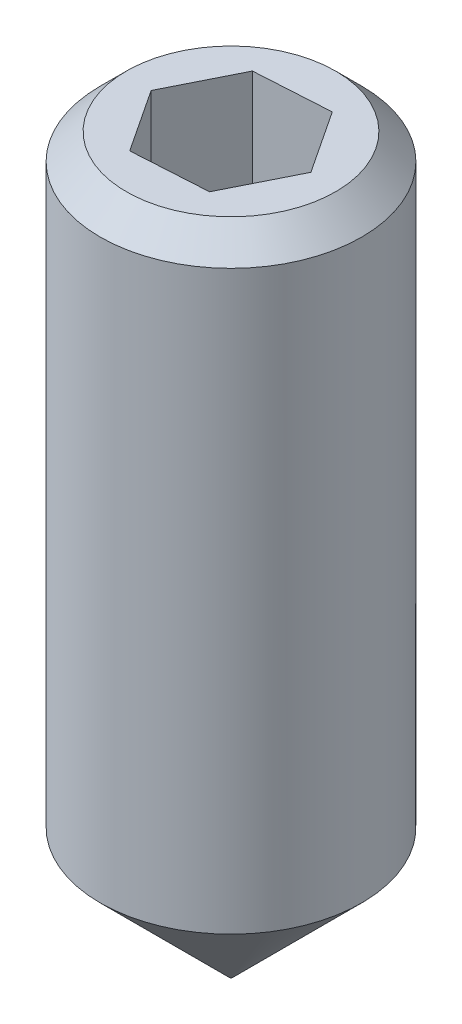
ISO-10303-21;
HEADER;
FILE_DESCRIPTION(('STEP AP214'),'2;1');
FILE_NAME('part.step','',(''),(''),'','','');
FILE_SCHEMA(('AUTOMOTIVE_DESIGN { 1 0 10303 214 1 1 1 1 }'));
ENDSEC;
DATA;
#1=APPLICATION_CONTEXT('core data for automotive mechanical design processes');
#2=APPLICATION_PROTOCOL_DEFINITION('international standard','automotive_design',2000,#1);
#3=PRODUCT_CONTEXT('',#1,'mechanical');
#4=PRODUCT('Part','Part','',(#3));
#5=PRODUCT_RELATED_PRODUCT_CATEGORY('part','',(#4));
#6=PRODUCT_DEFINITION_FORMATION('','',#4);
#7=PRODUCT_DEFINITION_CONTEXT('part definition',#1,'design');
#8=PRODUCT_DEFINITION('design','',#6,#7);
#9=PRODUCT_DEFINITION_SHAPE('','',#8);
#10=(LENGTH_UNIT() NAMED_UNIT(*) SI_UNIT(.MILLI.,.METRE.));
#11=(NAMED_UNIT(*) PLANE_ANGLE_UNIT() SI_UNIT($,.RADIAN.));
#12=(NAMED_UNIT(*) SI_UNIT($,.STERADIAN.) SOLID_ANGLE_UNIT());
#13=UNCERTAINTY_MEASURE_WITH_UNIT(LENGTH_MEASURE(1.E-05),#10,'distance_accuracy_value','');
#14=(GEOMETRIC_REPRESENTATION_CONTEXT(3) GLOBAL_UNCERTAINTY_ASSIGNED_CONTEXT((#13)) GLOBAL_UNIT_ASSIGNED_CONTEXT((#10,
#11,#12)) REPRESENTATION_CONTEXT('',''));
#15=CARTESIAN_POINT('',(0.,0.,0.));
#16=DIRECTION('',(0.,0.,1.));
#17=DIRECTION('',(1.,0.,0.));
#18=AXIS2_PLACEMENT_3D('',#15,#16,#17);
#19=CARTESIAN_POINT('',(0.,-14.,0.));
#20=DIRECTION('',(0.,1.,0.));
#21=DIRECTION('',(0.,0.,1.));
#22=AXIS2_PLACEMENT_3D('',#19,#20,#21);
#23=PLANE('',#22);
#24=CARTESIAN_POINT('',(0.,-14.,0.));
#25=DIRECTION('',(0.,1.,0.));
#26=DIRECTION('',(0.,0.,1.));
#27=AXIS2_PLACEMENT_3D('',#24,#25,#26);
#28=CIRCLE('',#27,0.0250000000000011);
#29=CARTESIAN_POINT('',(0.,-14.,0.0250000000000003));
#30=VERTEX_POINT('',#29);
#31=EDGE_CURVE('E139',#30,#30,#28,.F.);
#32=ORIENTED_EDGE('',*,*,#31,.T.);
#33=EDGE_LOOP('',(#32));
#34=FACE_BOUND('',#33,.T.);
#35=ADVANCED_FACE('F28',(#34),#23,.F.);
#36=CARTESIAN_POINT('',(0.,0.,0.));
#37=DIRECTION('',(0.,1.,0.));
#38=DIRECTION('',(0.,0.,1.));
#39=AXIS2_PLACEMENT_3D('',#36,#37,#38);
#40=CYLINDRICAL_SURFACE('',#39,2.5);
#41=CARTESIAN_POINT('',(0.,-0.500000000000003,0.));
#42=DIRECTION('',(0.,-1.,0.));
#43=DIRECTION('',(0.,0.,-1.));
#44=AXIS2_PLACEMENT_3D('',#41,#42,#43);
#45=CIRCLE('',#44,2.5);
#46=CARTESIAN_POINT('',(0.,-0.500000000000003,-2.5));
#47=VERTEX_POINT('',#46);
#48=EDGE_CURVE('E11',#47,#47,#45,.T.);
#49=ORIENTED_EDGE('',*,*,#48,.T.);
#50=EDGE_LOOP('',(#49));
#51=FACE_BOUND('',#50,.T.);
#52=CARTESIAN_POINT('',(0.,-11.525,0.));
#53=DIRECTION('',(0.,1.,0.));
#54=DIRECTION('',(0.,0.,1.));
#55=AXIS2_PLACEMENT_3D('',#52,#53,#54);
#56=CIRCLE('',#55,2.5);
#57=CARTESIAN_POINT('',(0.,-11.525,2.5));
#58=VERTEX_POINT('',#57);
#59=EDGE_CURVE('E130',#58,#58,#56,.T.);
#60=ORIENTED_EDGE('',*,*,#59,.T.);
#61=EDGE_LOOP('',(#60));
#62=FACE_BOUND('',#61,.T.);
#63=ADVANCED_FACE('F160',(#51,#62),#40,.T.);
#64=CARTESIAN_POINT('',(0.,0.,0.));
#65=DIRECTION('',(0.,-1.,0.));
#66=DIRECTION('',(0.,0.,-1.));
#67=AXIS2_PLACEMENT_3D('',#64,#65,#66);
#68=PLANE('',#67);
#69=DIRECTION('',(-0.998203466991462,0.,0.059915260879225));
#70=VECTOR('',#69,1.);
#71=CARTESIAN_POINT('',(0.645497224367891,0.,-1.29099444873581));
#72=LINE('',#71,#70);
#73=CARTESIAN_POINT('',(0.645497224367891,0.,-1.29099444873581));
#74=VERTEX_POINT('',#73);
#75=CARTESIAN_POINT('',(-0.795285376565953,0.,-1.20451421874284));
#76=VERTEX_POINT('',#75);
#77=EDGE_CURVE('E96',#74,#76,#72,.T.);
#78=ORIENTED_EDGE('',*,*,#77,.F.);
#79=DIRECTION('',(-0.550989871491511,0.,-0.834511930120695));
#80=VECTOR('',#79,1.);
#81=CARTESIAN_POINT('',(1.44078260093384,0.,-0.0864802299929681));
#82=LINE('',#81,#80);
#83=CARTESIAN_POINT('',(1.44078260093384,0.,-0.0864802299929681));
#84=VERTEX_POINT('',#83);
#85=EDGE_CURVE('E42',#84,#74,#82,.T.);
#86=ORIENTED_EDGE('',*,*,#85,.F.);
#87=DIRECTION('',(0.44721359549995,0.,-0.89442719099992));
#88=VECTOR('',#87,1.);
#89=CARTESIAN_POINT('',(0.795285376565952,0.,1.20451421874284));
#90=LINE('',#89,#88);
#91=CARTESIAN_POINT('',(0.795285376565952,0.,1.20451421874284));
#92=VERTEX_POINT('',#91);
#93=EDGE_CURVE('E112',#92,#84,#90,.T.);
#94=ORIENTED_EDGE('',*,*,#93,.F.);
#95=DIRECTION('',(0.998203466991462,0.,-0.0599152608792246));
#96=VECTOR('',#95,1.);
#97=CARTESIAN_POINT('',(-0.64549722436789,0.,1.29099444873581));
#98=LINE('',#97,#96);
#99=CARTESIAN_POINT('',(-0.64549722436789,0.,1.29099444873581));
#100=VERTEX_POINT('',#99);
#101=EDGE_CURVE('E106',#100,#92,#98,.T.);
#102=ORIENTED_EDGE('',*,*,#101,.F.);
#103=DIRECTION('',(0.550989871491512,0.,0.834511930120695));
#104=VECTOR('',#103,1.);
#105=CARTESIAN_POINT('',(-1.44078260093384,0.,0.0864802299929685));
#106=LINE('',#105,#104);
#107=CARTESIAN_POINT('',(-1.44078260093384,0.,0.0864802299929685));
#108=VERTEX_POINT('',#107);
#109=EDGE_CURVE('E104',#108,#100,#106,.T.);
#110=ORIENTED_EDGE('',*,*,#109,.F.);
#111=DIRECTION('',(-0.44721359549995,0.,0.89442719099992));
#112=VECTOR('',#111,1.);
#113=CARTESIAN_POINT('',(-0.795285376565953,0.,-1.20451421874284));
#114=LINE('',#113,#112);
#115=EDGE_CURVE('E85',#76,#108,#114,.T.);
#116=ORIENTED_EDGE('',*,*,#115,.F.);
#117=EDGE_LOOP('',(#78,#86,#94,#102,#110,#116));
#118=FACE_BOUND('',#117,.T.);
#119=CARTESIAN_POINT('',(0.,0.,0.));
#120=DIRECTION('',(0.,-1.,0.));
#121=DIRECTION('',(0.,0.,-1.));
#122=AXIS2_PLACEMENT_3D('',#119,#120,#121);
#123=CIRCLE('',#122,2.);
#124=CARTESIAN_POINT('',(0.,0.,-2.));
#125=VERTEX_POINT('',#124);
#126=EDGE_CURVE('E35',#125,#125,#123,.F.);
#127=ORIENTED_EDGE('',*,*,#126,.T.);
#128=EDGE_LOOP('',(#127));
#129=FACE_BOUND('',#128,.T.);
#130=ADVANCED_FACE('F100',(#118,#129),#68,.F.);
#131=CARTESIAN_POINT('',(0.,-11.525,0.));
#132=DIRECTION('',(0.,1.,0.));
#133=DIRECTION('',(0.,0.,1.));
#134=AXIS2_PLACEMENT_3D('',#131,#132,#133);
#135=CONICAL_SURFACE('',#134,2.5,0.785398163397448);
#136=CARTESIAN_POINT('',(0.,-14.,0.0250000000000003));
#137=CARTESIAN_POINT('',(0.,-13.97421875,0.0507812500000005));
#138=CARTESIAN_POINT('',(0.,-13.9484375,0.0765625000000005));
#139=CARTESIAN_POINT('',(0.,-13.896875,0.128125));
#140=CARTESIAN_POINT('',(0.,-13.87109375,0.15390625));
#141=CARTESIAN_POINT('',(0.,-13.81953125,0.20546875));
#142=CARTESIAN_POINT('',(0.,-13.79375,0.23125));
#143=CARTESIAN_POINT('',(0.,-13.7421875,0.2828125));
#144=CARTESIAN_POINT('',(0.,-13.71640625,0.30859375));
#145=CARTESIAN_POINT('',(0.,-13.66484375,0.36015625));
#146=CARTESIAN_POINT('',(0.,-13.6390625,0.3859375));
#147=CARTESIAN_POINT('',(0.,-13.5875,0.4375));
#148=CARTESIAN_POINT('',(0.,-13.56171875,0.46328125));
#149=CARTESIAN_POINT('',(0.,-13.51015625,0.51484375));
#150=CARTESIAN_POINT('',(0.,-13.484375,0.540625));
#151=CARTESIAN_POINT('',(0.,-13.4328125,0.5921875));
#152=CARTESIAN_POINT('',(0.,-13.40703125,0.61796875));
#153=CARTESIAN_POINT('',(0.,-13.35546875,0.66953125));
#154=CARTESIAN_POINT('',(0.,-13.3296875,0.6953125));
#155=CARTESIAN_POINT('',(0.,-13.278125,0.746875));
#156=CARTESIAN_POINT('',(0.,-13.25234375,0.77265625));
#157=CARTESIAN_POINT('',(0.,-13.20078125,0.82421875));
#158=CARTESIAN_POINT('',(0.,-13.175,0.85));
#159=CARTESIAN_POINT('',(0.,-13.1234375,0.9015625));
#160=CARTESIAN_POINT('',(0.,-13.09765625,0.92734375));
#161=CARTESIAN_POINT('',(0.,-13.04609375,0.97890625));
#162=CARTESIAN_POINT('',(0.,-13.0203125,1.0046875));
#163=CARTESIAN_POINT('',(0.,-12.96875,1.05625));
#164=CARTESIAN_POINT('',(0.,-12.94296875,1.08203125));
#165=CARTESIAN_POINT('',(0.,-12.89140625,1.13359375));
#166=CARTESIAN_POINT('',(0.,-12.865625,1.159375));
#167=CARTESIAN_POINT('',(0.,-12.8140625,1.2109375));
#168=CARTESIAN_POINT('',(0.,-12.78828125,1.23671875));
#169=CARTESIAN_POINT('',(0.,-12.73671875,1.28828125));
#170=CARTESIAN_POINT('',(0.,-12.7109375,1.3140625));
#171=CARTESIAN_POINT('',(0.,-12.659375,1.365625));
#172=CARTESIAN_POINT('',(0.,-12.63359375,1.39140625));
#173=CARTESIAN_POINT('',(0.,-12.58203125,1.44296875));
#174=CARTESIAN_POINT('',(0.,-12.55625,1.46875));
#175=CARTESIAN_POINT('',(0.,-12.5046875,1.5203125));
#176=CARTESIAN_POINT('',(0.,-12.47890625,1.54609375));
#177=CARTESIAN_POINT('',(0.,-12.42734375,1.59765625));
#178=CARTESIAN_POINT('',(0.,-12.4015625,1.6234375));
#179=CARTESIAN_POINT('',(0.,-12.35,1.675));
#180=CARTESIAN_POINT('',(0.,-12.32421875,1.70078125));
#181=CARTESIAN_POINT('',(0.,-12.27265625,1.75234375));
#182=CARTESIAN_POINT('',(0.,-12.246875,1.778125));
#183=CARTESIAN_POINT('',(0.,-12.1953125,1.8296875));
#184=CARTESIAN_POINT('',(0.,-12.16953125,1.85546875));
#185=CARTESIAN_POINT('',(0.,-12.11796875,1.90703125));
#186=CARTESIAN_POINT('',(0.,-12.0921875,1.9328125));
#187=CARTESIAN_POINT('',(0.,-12.040625,1.984375));
#188=CARTESIAN_POINT('',(0.,-12.01484375,2.01015625));
#189=CARTESIAN_POINT('',(0.,-11.96328125,2.06171875));
#190=CARTESIAN_POINT('',(0.,-11.9375,2.0875));
#191=CARTESIAN_POINT('',(0.,-11.8859375,2.1390625));
#192=CARTESIAN_POINT('',(0.,-11.86015625,2.16484375));
#193=CARTESIAN_POINT('',(0.,-11.80859375,2.21640625));
#194=CARTESIAN_POINT('',(0.,-11.7828125,2.2421875));
#195=CARTESIAN_POINT('',(0.,-11.73125,2.29375));
#196=CARTESIAN_POINT('',(0.,-11.70546875,2.31953125));
#197=CARTESIAN_POINT('',(0.,-11.65390625,2.37109375));
#198=CARTESIAN_POINT('',(0.,-11.628125,2.396875));
#199=CARTESIAN_POINT('',(0.,-11.5765625,2.4484375));
#200=CARTESIAN_POINT('',(0.,-11.55078125,2.47421875));
#201=CARTESIAN_POINT('',(0.,-11.525,2.5));
#202=B_SPLINE_CURVE_WITH_KNOTS('',3,(#136,#137,#138,#139,#140,#141,#142,#143,#144,#145,#146,
#147,#148,#149,#150,#151,#152,#153,#154,#155,#156,#157,#158,#159,#160,#161,#162,#163,#164,#165,
#166,#167,#168,#169,#170,#171,#172,#173,#174,#175,#176,#177,#178,#179,#180,#181,#182,#183,#184,
#185,#186,#187,#188,#189,#190,#191,#192,#193,#194,#195,#196,#197,#198,#199,#200,#201),
.UNSPECIFIED.,.F.,.F.,(4,2,2,2,2,2,2,2,2,2,2,2,2,2,2,2,2,2,2,2,2,2,2,2,2,2,2,2,2,2,2,2,4),(0.,
0.109380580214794,0.218761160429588,0.328141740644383,0.437522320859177,0.546902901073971,
0.656283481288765,0.765664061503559,0.875044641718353,0.984425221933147,1.09380580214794,
1.20318638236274,1.31256696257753,1.42194754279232,1.53132812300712,1.64070870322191,
1.75008928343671,1.8594698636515,1.96885044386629,2.07823102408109,2.18761160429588,
2.29699218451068,2.40637276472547,2.51575334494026,2.62513392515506,2.73451450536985,
2.84389508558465,2.95327566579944,3.06265624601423,3.17203682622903,3.28141740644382,
3.39079798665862,3.50017856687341),.UNSPECIFIED.);
#203=EDGE_CURVE('BSEAM147',#30,#58,#202,.T.);
#204=ORIENTED_EDGE('',*,*,#31,.F.);
#205=ORIENTED_EDGE('',*,*,#59,.F.);
#206=ORIENTED_EDGE('',*,*,#203,.T.);
#207=ORIENTED_EDGE('',*,*,#203,.F.);
#208=EDGE_LOOP('',(#204,#206,#205,#207));
#209=FACE_BOUND('',#208,.T.);
#210=ADVANCED_FACE('F147',(#209),#135,.T.);
#211=CARTESIAN_POINT('',(0.,0.,0.));
#212=DIRECTION('',(0.,-1.,0.));
#213=DIRECTION('',(0.,0.,-1.));
#214=AXIS2_PLACEMENT_3D('',#211,#212,#213);
#215=CONICAL_SURFACE('',#214,2.,0.785398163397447);
#216=ORIENTED_EDGE('',*,*,#48,.F.);
#217=EDGE_LOOP('',(#216));
#218=FACE_BOUND('',#217,.T.);
#219=ORIENTED_EDGE('',*,*,#126,.F.);
#220=EDGE_LOOP('',(#219));
#221=FACE_BOUND('',#220,.T.);
#222=ADVANCED_FACE('F144',(#218,#221),#215,.T.);
#223=CARTESIAN_POINT('',(1.44078260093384,-3.5,-0.0864802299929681));
#224=DIRECTION('',(0.834511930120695,0.,-0.550989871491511));
#225=DIRECTION('',(-0.550989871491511,0.,-0.834511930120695));
#226=AXIS2_PLACEMENT_3D('',#223,#224,#225);
#227=PLANE('',#226);
#228=ORIENTED_EDGE('',*,*,#85,.T.);
#229=DIRECTION('',(0.,1.,0.));
#230=VECTOR('',#229,1.);
#231=CARTESIAN_POINT('',(0.645497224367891,-3.5,-1.29099444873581));
#232=LINE('',#231,#230);
#233=CARTESIAN_POINT('',(0.645497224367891,-3.5,-1.29099444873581));
#234=VERTEX_POINT('',#233);
#235=EDGE_CURVE('E93',#234,#74,#232,.T.);
#236=ORIENTED_EDGE('',*,*,#235,.F.);
#237=DIRECTION('',(-0.550989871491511,0.,-0.834511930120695));
#238=VECTOR('',#237,1.);
#239=CARTESIAN_POINT('',(1.44078260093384,-3.5,-0.0864802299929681));
#240=LINE('',#239,#238);
#241=CARTESIAN_POINT('',(1.44078260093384,-3.5,-0.0864802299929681));
#242=VERTEX_POINT('',#241);
#243=EDGE_CURVE('E114',#242,#234,#240,.T.);
#244=ORIENTED_EDGE('',*,*,#243,.F.);
#245=DIRECTION('',(0.,1.,0.));
#246=VECTOR('',#245,1.);
#247=CARTESIAN_POINT('',(1.44078260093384,-3.5,-0.0864802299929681));
#248=LINE('',#247,#246);
#249=EDGE_CURVE('E49',#242,#84,#248,.T.);
#250=ORIENTED_EDGE('',*,*,#249,.T.);
#251=EDGE_LOOP('',(#228,#236,#244,#250));
#252=FACE_BOUND('',#251,.T.);
#253=ADVANCED_FACE('F146',(#252),#227,.F.);
#254=CARTESIAN_POINT('',(0.795285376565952,-3.5,1.20451421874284));
#255=DIRECTION('',(0.89442719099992,0.,0.44721359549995));
#256=DIRECTION('',(0.44721359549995,0.,-0.89442719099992));
#257=AXIS2_PLACEMENT_3D('',#254,#255,#256);
#258=PLANE('',#257);
#259=ORIENTED_EDGE('',*,*,#93,.T.);
#260=ORIENTED_EDGE('',*,*,#249,.F.);
#261=DIRECTION('',(0.44721359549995,0.,-0.89442719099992));
#262=VECTOR('',#261,1.);
#263=CARTESIAN_POINT('',(0.795285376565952,-3.5,1.20451421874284));
#264=LINE('',#263,#262);
#265=CARTESIAN_POINT('',(0.795285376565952,-3.5,1.20451421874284));
#266=VERTEX_POINT('',#265);
#267=EDGE_CURVE('E126',#266,#242,#264,.T.);
#268=ORIENTED_EDGE('',*,*,#267,.F.);
#269=DIRECTION('',(0.,1.,0.));
#270=VECTOR('',#269,1.);
#271=CARTESIAN_POINT('',(0.795285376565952,-3.5,1.20451421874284));
#272=LINE('',#271,#270);
#273=EDGE_CURVE('E131',#266,#92,#272,.T.);
#274=ORIENTED_EDGE('',*,*,#273,.T.);
#275=EDGE_LOOP('',(#259,#260,#268,#274));
#276=FACE_BOUND('',#275,.T.);
#277=ADVANCED_FACE('F154',(#276),#258,.F.);
#278=CARTESIAN_POINT('',(-0.64549722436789,-3.5,1.29099444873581));
#279=DIRECTION('',(0.0599152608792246,0.,0.998203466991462));
#280=DIRECTION('',(0.998203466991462,0.,-0.0599152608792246));
#281=AXIS2_PLACEMENT_3D('',#278,#279,#280);
#282=PLANE('',#281);
#283=ORIENTED_EDGE('',*,*,#101,.T.);
#284=ORIENTED_EDGE('',*,*,#273,.F.);
#285=DIRECTION('',(0.998203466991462,0.,-0.0599152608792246));
#286=VECTOR('',#285,1.);
#287=CARTESIAN_POINT('',(-0.64549722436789,-3.5,1.29099444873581));
#288=LINE('',#287,#286);
#289=CARTESIAN_POINT('',(-0.64549722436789,-3.5,1.29099444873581));
#290=VERTEX_POINT('',#289);
#291=EDGE_CURVE('E123',#290,#266,#288,.T.);
#292=ORIENTED_EDGE('',*,*,#291,.F.);
#293=DIRECTION('',(0.,1.,0.));
#294=VECTOR('',#293,1.);
#295=CARTESIAN_POINT('',(-0.64549722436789,-3.5,1.29099444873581));
#296=LINE('',#295,#294);
#297=EDGE_CURVE('E133',#290,#100,#296,.T.);
#298=ORIENTED_EDGE('',*,*,#297,.T.);
#299=EDGE_LOOP('',(#283,#284,#292,#298));
#300=FACE_BOUND('',#299,.T.);
#301=ADVANCED_FACE('F205',(#300),#282,.F.);
#302=CARTESIAN_POINT('',(-1.44078260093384,-3.5,0.0864802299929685));
#303=DIRECTION('',(-0.834511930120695,0.,0.550989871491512));
#304=DIRECTION('',(0.550989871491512,0.,0.834511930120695));
#305=AXIS2_PLACEMENT_3D('',#302,#303,#304);
#306=PLANE('',#305);
#307=ORIENTED_EDGE('',*,*,#109,.T.);
#308=ORIENTED_EDGE('',*,*,#297,.F.);
#309=DIRECTION('',(0.550989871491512,0.,0.834511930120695));
#310=VECTOR('',#309,1.);
#311=CARTESIAN_POINT('',(-1.44078260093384,-3.5,0.0864802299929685));
#312=LINE('',#311,#310);
#313=CARTESIAN_POINT('',(-1.44078260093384,-3.5,0.0864802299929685));
#314=VERTEX_POINT('',#313);
#315=EDGE_CURVE('E120',#314,#290,#312,.T.);
#316=ORIENTED_EDGE('',*,*,#315,.F.);
#317=DIRECTION('',(0.,1.,0.));
#318=VECTOR('',#317,1.);
#319=CARTESIAN_POINT('',(-1.44078260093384,-3.5,0.0864802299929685));
#320=LINE('',#319,#318);
#321=EDGE_CURVE('E92',#314,#108,#320,.T.);
#322=ORIENTED_EDGE('',*,*,#321,.T.);
#323=EDGE_LOOP('',(#307,#308,#316,#322));
#324=FACE_BOUND('',#323,.T.);
#325=ADVANCED_FACE('F213',(#324),#306,.F.);
#326=CARTESIAN_POINT('',(-0.795285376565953,-3.5,-1.20451421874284));
#327=DIRECTION('',(-0.89442719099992,0.,-0.44721359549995));
#328=DIRECTION('',(-0.44721359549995,0.,0.89442719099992));
#329=AXIS2_PLACEMENT_3D('',#326,#327,#328);
#330=PLANE('',#329);
#331=ORIENTED_EDGE('',*,*,#115,.T.);
#332=ORIENTED_EDGE('',*,*,#321,.F.);
#333=DIRECTION('',(-0.44721359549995,0.,0.89442719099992));
#334=VECTOR('',#333,1.);
#335=CARTESIAN_POINT('',(-0.795285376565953,-3.5,-1.20451421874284));
#336=LINE('',#335,#334);
#337=CARTESIAN_POINT('',(-0.795285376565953,-3.5,-1.20451421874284));
#338=VERTEX_POINT('',#337);
#339=EDGE_CURVE('E88',#338,#314,#336,.T.);
#340=ORIENTED_EDGE('',*,*,#339,.F.);
#341=DIRECTION('',(0.,1.,0.));
#342=VECTOR('',#341,1.);
#343=CARTESIAN_POINT('',(-0.795285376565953,-3.5,-1.20451421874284));
#344=LINE('',#343,#342);
#345=EDGE_CURVE('E81',#338,#76,#344,.T.);
#346=ORIENTED_EDGE('',*,*,#345,.T.);
#347=EDGE_LOOP('',(#331,#332,#340,#346));
#348=FACE_BOUND('',#347,.T.);
#349=ADVANCED_FACE('F83',(#348),#330,.F.);
#350=CARTESIAN_POINT('',(0.645497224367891,-3.5,-1.29099444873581));
#351=DIRECTION('',(-0.059915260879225,0.,-0.998203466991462));
#352=DIRECTION('',(-0.998203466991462,0.,0.059915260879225));
#353=AXIS2_PLACEMENT_3D('',#350,#351,#352);
#354=PLANE('',#353);
#355=ORIENTED_EDGE('',*,*,#77,.T.);
#356=ORIENTED_EDGE('',*,*,#345,.F.);
#357=DIRECTION('',(-0.998203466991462,0.,0.059915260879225));
#358=VECTOR('',#357,1.);
#359=CARTESIAN_POINT('',(0.645497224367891,-3.5,-1.29099444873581));
#360=LINE('',#359,#358);
#361=EDGE_CURVE('E117',#234,#338,#360,.T.);
#362=ORIENTED_EDGE('',*,*,#361,.F.);
#363=ORIENTED_EDGE('',*,*,#235,.T.);
#364=EDGE_LOOP('',(#355,#356,#362,#363));
#365=FACE_BOUND('',#364,.T.);
#366=ADVANCED_FACE('F97',(#365),#354,.F.);
#367=CARTESIAN_POINT('',(0.645497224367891,-3.5,-1.29099444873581));
#368=DIRECTION('',(0.,1.,0.));
#369=DIRECTION('',(0.,0.,1.));
#370=AXIS2_PLACEMENT_3D('',#367,#368,#369);
#371=PLANE('',#370);
#372=ORIENTED_EDGE('',*,*,#243,.T.);
#373=ORIENTED_EDGE('',*,*,#361,.T.);
#374=ORIENTED_EDGE('',*,*,#339,.T.);
#375=ORIENTED_EDGE('',*,*,#315,.T.);
#376=ORIENTED_EDGE('',*,*,#291,.T.);
#377=ORIENTED_EDGE('',*,*,#267,.T.);
#378=EDGE_LOOP('',(#372,#373,#374,#375,#376,#377));
#379=FACE_BOUND('',#378,.T.);
#380=ADVANCED_FACE('F237',(#379),#371,.T.);
#381=CLOSED_SHELL('',(#35,#63,#130,#210,#222,#253,#277,#301,#325,#349,#366,#380));
#382=MANIFOLD_SOLID_BREP('B2',#381);
#383=ADVANCED_BREP_SHAPE_REPRESENTATION('',(#18,#382),#14);
#384=SHAPE_DEFINITION_REPRESENTATION(#9,#383);
ENDSEC;
END-ISO-10303-21;
